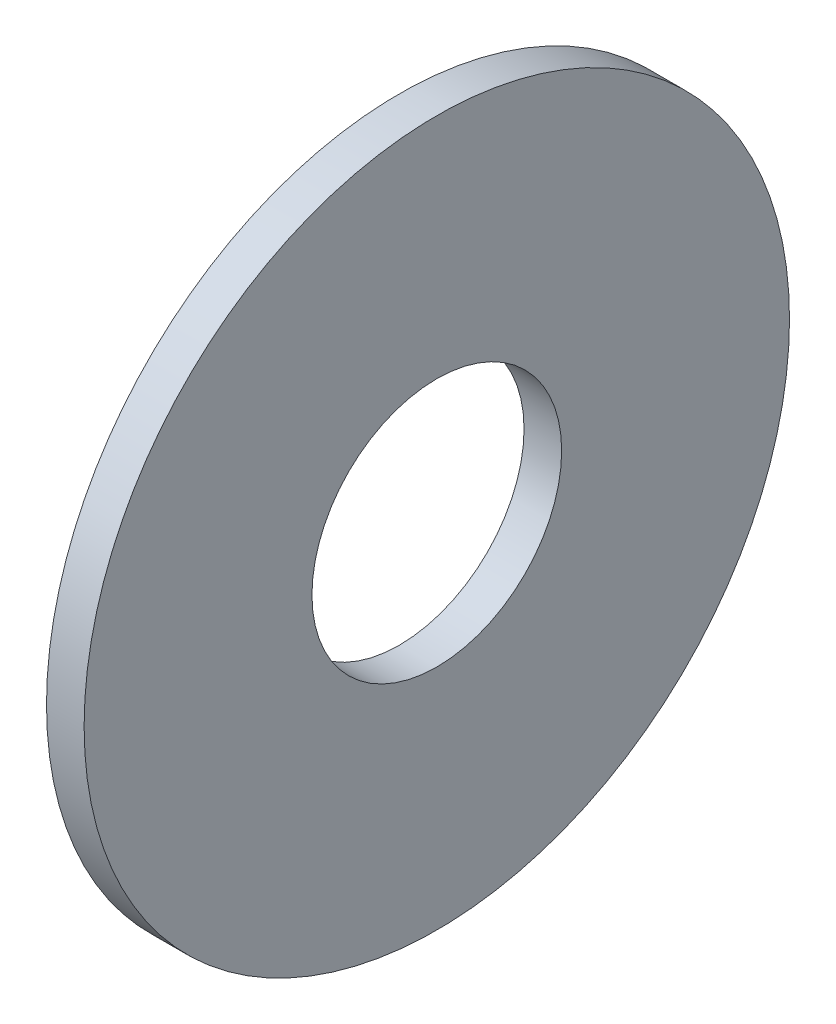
ISO-10303-21;
HEADER;
FILE_DESCRIPTION(('STEP AP214'),'2;1');
FILE_NAME('part.step','',(''),(''),'','','');
FILE_SCHEMA(('AUTOMOTIVE_DESIGN { 1 0 10303 214 1 1 1 1 }'));
ENDSEC;
DATA;
#1=APPLICATION_CONTEXT('core data for automotive mechanical design processes');
#2=APPLICATION_PROTOCOL_DEFINITION('international standard','automotive_design',2000,#1);
#3=PRODUCT_CONTEXT('',#1,'mechanical');
#4=PRODUCT('Part','Part','',(#3));
#5=PRODUCT_RELATED_PRODUCT_CATEGORY('part','',(#4));
#6=PRODUCT_DEFINITION_FORMATION('','',#4);
#7=PRODUCT_DEFINITION_CONTEXT('part definition',#1,'design');
#8=PRODUCT_DEFINITION('design','',#6,#7);
#9=PRODUCT_DEFINITION_SHAPE('','',#8);
#10=(LENGTH_UNIT() NAMED_UNIT(*) SI_UNIT(.MILLI.,.METRE.));
#11=(NAMED_UNIT(*) PLANE_ANGLE_UNIT() SI_UNIT($,.RADIAN.));
#12=(NAMED_UNIT(*) SI_UNIT($,.STERADIAN.) SOLID_ANGLE_UNIT());
#13=UNCERTAINTY_MEASURE_WITH_UNIT(LENGTH_MEASURE(1.E-05),#10,'distance_accuracy_value','');
#14=(GEOMETRIC_REPRESENTATION_CONTEXT(3) GLOBAL_UNCERTAINTY_ASSIGNED_CONTEXT((#13)) GLOBAL_UNIT_ASSIGNED_CONTEXT((#10,
#11,#12)) REPRESENTATION_CONTEXT('',''));
#15=CARTESIAN_POINT('',(0.,0.,0.));
#16=DIRECTION('',(0.,0.,1.));
#17=DIRECTION('',(1.,0.,0.));
#18=AXIS2_PLACEMENT_3D('',#15,#16,#17);
#19=CARTESIAN_POINT('',(-34.9249999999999,0.,0.));
#20=DIRECTION('',(-1.,0.,0.));
#21=DIRECTION('',(0.,0.,1.));
#22=AXIS2_PLACEMENT_3D('',#19,#20,#21);
#23=CYLINDRICAL_SURFACE('',#22,13.4874);
#24=CARTESIAN_POINT('',(0.,0.,0.));
#25=DIRECTION('',(-1.,0.,0.));
#26=DIRECTION('',(0.,0.,1.));
#27=AXIS2_PLACEMENT_3D('',#24,#25,#26);
#28=CIRCLE('',#27,13.4874);
#29=CARTESIAN_POINT('',(0.,0.,13.4874));
#30=VERTEX_POINT('',#29);
#31=EDGE_CURVE('E10',#30,#30,#28,.T.);
#32=ORIENTED_EDGE('',*,*,#31,.F.);
#33=EDGE_LOOP('',(#32));
#34=FACE_BOUND('',#33,.T.);
#35=CARTESIAN_POINT('',(-4.06399999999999,0.,0.));
#36=DIRECTION('',(-1.,0.,0.));
#37=DIRECTION('',(0.,0.,1.));
#38=AXIS2_PLACEMENT_3D('',#35,#36,#37);
#39=CIRCLE('',#38,13.4874);
#40=CARTESIAN_POINT('',(-4.06399999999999,0.,13.4874));
#41=VERTEX_POINT('',#40);
#42=EDGE_CURVE('E45',#41,#41,#39,.T.);
#43=ORIENTED_EDGE('',*,*,#42,.T.);
#44=EDGE_LOOP('',(#43));
#45=FACE_BOUND('',#44,.T.);
#46=ADVANCED_FACE('F31',(#34,#45),#23,.F.);
#47=CARTESIAN_POINT('',(0.,13.4874,0.));
#48=DIRECTION('',(-1.,0.,0.));
#49=DIRECTION('',(0.,0.,1.));
#50=AXIS2_PLACEMENT_3D('',#47,#48,#49);
#51=PLANE('',#50);
#52=CARTESIAN_POINT('',(0.,0.,0.));
#53=DIRECTION('',(-1.,0.,0.));
#54=DIRECTION('',(0.,0.,1.));
#55=AXIS2_PLACEMENT_3D('',#52,#53,#54);
#56=CIRCLE('',#55,38.1);
#57=CARTESIAN_POINT('',(0.,0.,38.1));
#58=VERTEX_POINT('',#57);
#59=EDGE_CURVE('E37',#58,#58,#56,.T.);
#60=ORIENTED_EDGE('',*,*,#59,.F.);
#61=EDGE_LOOP('',(#60));
#62=FACE_BOUND('',#61,.T.);
#63=ORIENTED_EDGE('',*,*,#31,.T.);
#64=EDGE_LOOP('',(#63));
#65=FACE_BOUND('',#64,.T.);
#66=ADVANCED_FACE('F60',(#62,#65),#51,.F.);
#67=CARTESIAN_POINT('',(-34.9249999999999,0.,0.));
#68=DIRECTION('',(-1.,0.,0.));
#69=DIRECTION('',(0.,0.,1.));
#70=AXIS2_PLACEMENT_3D('',#67,#68,#69);
#71=CYLINDRICAL_SURFACE('',#70,38.1);
#72=CARTESIAN_POINT('',(-4.064,0.,0.));
#73=DIRECTION('',(-1.,0.,0.));
#74=DIRECTION('',(0.,0.,1.));
#75=AXIS2_PLACEMENT_3D('',#72,#73,#74);
#76=CIRCLE('',#75,38.1);
#77=CARTESIAN_POINT('',(-4.064,0.,38.1));
#78=VERTEX_POINT('',#77);
#79=EDGE_CURVE('E41',#78,#78,#76,.T.);
#80=ORIENTED_EDGE('',*,*,#79,.F.);
#81=EDGE_LOOP('',(#80));
#82=FACE_BOUND('',#81,.T.);
#83=ORIENTED_EDGE('',*,*,#59,.T.);
#84=EDGE_LOOP('',(#83));
#85=FACE_BOUND('',#84,.T.);
#86=ADVANCED_FACE('F55',(#82,#85),#71,.T.);
#87=CARTESIAN_POINT('',(-4.064,38.1,0.));
#88=DIRECTION('',(1.,0.,0.));
#89=DIRECTION('',(0.,0.,-1.));
#90=AXIS2_PLACEMENT_3D('',#87,#88,#89);
#91=PLANE('',#90);
#92=ORIENTED_EDGE('',*,*,#42,.F.);
#93=EDGE_LOOP('',(#92));
#94=FACE_BOUND('',#93,.T.);
#95=ORIENTED_EDGE('',*,*,#79,.T.);
#96=EDGE_LOOP('',(#95));
#97=FACE_BOUND('',#96,.T.);
#98=ADVANCED_FACE('F52',(#94,#97),#91,.F.);
#99=CLOSED_SHELL('',(#46,#66,#86,#98));
#100=MANIFOLD_SOLID_BREP('B2',#99);
#101=ADVANCED_BREP_SHAPE_REPRESENTATION('',(#18,#100),#14);
#102=SHAPE_DEFINITION_REPRESENTATION(#9,#101);
ENDSEC;
END-ISO-10303-21;
